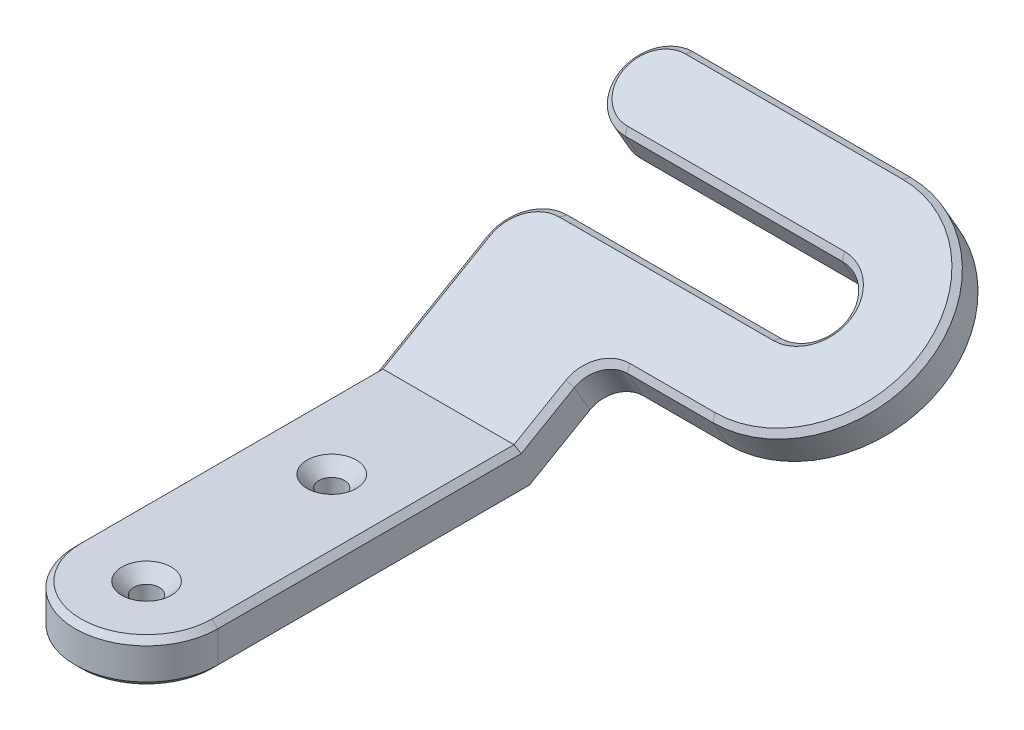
from build123d import *

# Parameters (mm, degrees)
EXTRUDE_THIN1_DEPTH                             = 25
FILLET1_RADIUS                                  = 25
FILLET1_LENGTH                                  = 15
EXTRUDE1_DEPTH                                  = 15
CSK_FOR_M8_FLAT_HEAD_MACHINE_SCREW1_D           = 9
CSK_FOR_M8_FLAT_HEAD_MACHINE_SCREW1_CSINK_D     = 17.3
CSK_FOR_M8_FLAT_HEAD_MACHINE_SCREW1_CSINK_ANGLE = 90
CHAMFER1_SIZE                                   = 2


with BuildPart() as part:
    # Sketch1 → Extrude-Thin1 (new, symmetric)
    with BuildSketch(Plane(origin=(0, 0, 0), x_dir=(0, 0, -1), z_dir=(1, 0, 0))):
        Polygon((21.650635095, 12.5), (0, 0), (-135, 0), (-135, 15), (-4.019237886, 15), (14.150635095, 25.490381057), align=None)
    extrude(amount=EXTRUDE_THIN1_DEPTH, both=True)

    # Fillet1: full round fillet: the end face becomes a half cylinder, R = half its width
    fillet1_face = Plane((0, 7.5, 135), x_dir=(0, 1, 0), z_dir=(0, 0, 1))  # on the end face: x along it, z out of the body
    fillet1_slab = fillet1_face.offset(-FILLET1_RADIUS / 2) * Box(FILLET1_LENGTH, 2 * FILLET1_RADIUS, FILLET1_RADIUS, mode=Mode.PRIVATE)  # the body's end, R deep
    fillet1_round = Plane((0, 7.5, 110), x_dir=(0, 0, 1), z_dir=(0, 1, 0)) * Cylinder(FILLET1_RADIUS, FILLET1_LENGTH, mode=Mode.PRIVATE)  # its axis R under the face
    add(fillet1_slab - fillet1_round, mode=Mode.SUBTRACT)

    # Sketch2 → Extrude1 (add)
    with BuildSketch(Plane(origin=(0, 12.990381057, 7.5), x_dir=(-1, 0, 0), z_dir=(0, 0.8660254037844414, 0.49999999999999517))):
        with BuildLine():
            Line((25, -25), (25, -47.5))
            ThreePointArc((25, -47.5), (20.606601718, -58.106601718), (10, -62.5))
            Line((10, -62.5), (-65, -62.5))
            ThreePointArc((-65, -62.5), (-77.5, -75), (-65, -87.5))
            Line((-65, -87.5), (11.25, -87.5))
            ThreePointArc((11.25, -87.5), (25, -101.25), (11.25, -115))
            Line((11.25, -115), (-65, -115))
            ThreePointArc((-65, -115), (-105, -75), (-65, -35))
            Line((-65, -35), (-35, -35))
            ThreePointArc((-35, -35), (-27.928932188, -32.071067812), (-25, -25))
            Line((-25, -25), (25, -25))
        make_face()
    extrude(amount=-EXTRUDE1_DEPTH)

    # CSK for M8 Flat Head Machine Screw1 (through all)
    with Locations(Plane(origin=(0, 15, 0), x_dir=(-1, 0, 0), z_dir=(0, 1, 0))):
        with Locations((0, 110), (0, 45)):
            CounterSinkHole(CSK_FOR_M8_FLAT_HEAD_MACHINE_SCREW1_D / 2, CSK_FOR_M8_FLAT_HEAD_MACHINE_SCREW1_CSINK_D / 2, counter_sink_angle=CSK_FOR_M8_FLAT_HEAD_MACHINE_SCREW1_CSINK_ANGLE)

    # Chamfer1
    chamfer1_edges = [part.edges().sort_by_distance(p)[0] for p in [
        (25, 20.245190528, -5.065698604),
        (25, 15, 57.009618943),
        (25, 0, 55),
        (-25, 0, 55),
        (-25, 15, 57.009618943),
        (0, 15, 135),
        (0, 0, 135),
        (27.928932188, 29.025914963, -20.274359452),
        (50, 30.490381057, -22.810889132),
        (105, 50.490381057, -57.451905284),
        (26.875, 70.490381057, -92.092921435),
        (-25, 63.615381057, -80.185072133),
        (26.875, 56.740381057, -68.277222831),
        (77.5, 50.490381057, -57.451905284),
        (27.5, 44.240381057, -46.626587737),
        (-20.606601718, 42.043681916, -42.821793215),
        (-20.606601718, 29.053300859, -50.321793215),
        (27.5, 31.25, -54.126587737),
        (77.5, 37.5, -64.951905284),
        (26.875, 43.75, -75.777222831),
        (-25, 50.625, -87.685072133),
        (26.875, 57.5, -99.592921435),
        (105, 37.5, -64.951905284),
        (50, 17.5, -30.310889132),
        (27.928932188, 16.035533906, -27.774359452),
        (25, 6.25, -10.825317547),
        (-25, 25.870190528, -14.808484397),
        (-25, 11.875, -20.56810334),
    ]]
    chamfer(chamfer1_edges, length=CHAMFER1_SIZE)


solid = part.part
